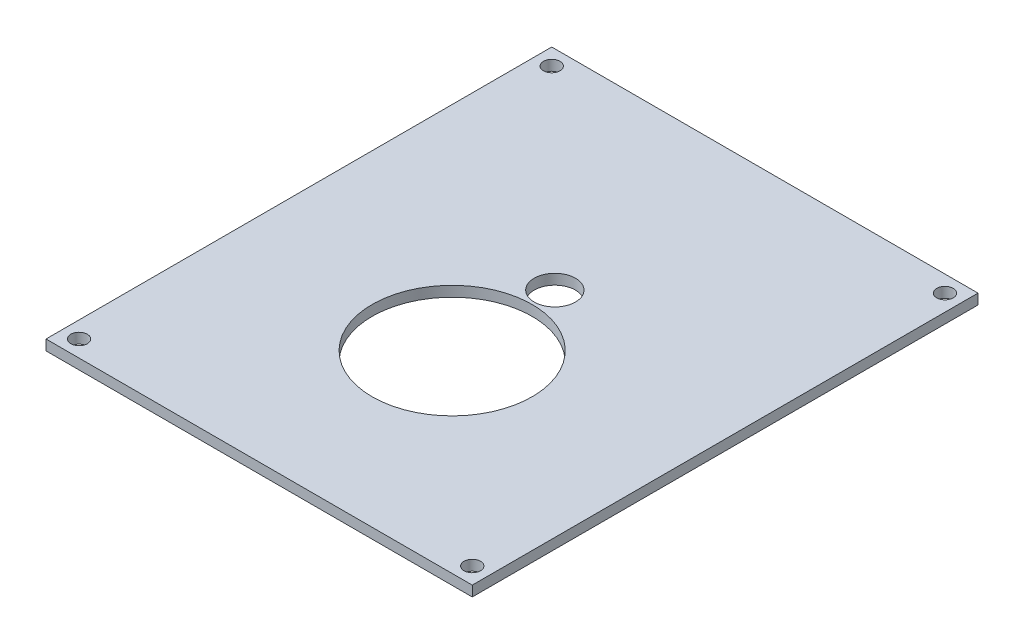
from build123d import *

# Parameters (mm, degrees)
SKETCH1_W                  = 82.6
SKETCH1_H                  = 98
BOSS_EXTRUDE1_DEPTH        = 2
F_3_2_3_2_DIAMETER_HOLE1_D = 3.2
SKETCH4_R                  = 15.5
CUT_EXTRUDE1_DEPTH         = 2
SKETCH5_R                  = 4
CUT_EXTRUDE2_DEPTH         = 10


with BuildPart() as part:
    # Sketch1 → Boss-Extrude1 (new body)
    with BuildSketch(Plane(origin=(0, 0, 0), x_dir=(1, 0, 0), z_dir=(0, 1, 0))):
        Rectangle(SKETCH1_W, SKETCH1_H)
    extrude(amount=BOSS_EXTRUDE1_DEPTH)

    # 3.2 _3.2_ Diameter Hole1 (through all)
    with Locations(Plane(origin=(0, 2, 0), x_dir=(1, 0, 0), z_dir=(0, 1, 0))):
        with Locations((-38.1, 45.8), (38.1, 45.8), (38.1, -45.8), (-38.1, -45.8)):
            Hole(F_3_2_3_2_DIAMETER_HOLE1_D / 2)

    # Sketch4 → Cut-Extrude1 (cut)
    with BuildSketch(Plane(origin=(0, 2, 0), x_dir=(1, 0, 0), z_dir=(0, 1, 0))):
        with Locations(Location((0, -11.6, 0), (0, 0, 270))):
            Circle(SKETCH4_R)
    extrude(amount=-CUT_EXTRUDE1_DEPTH, mode=Mode.SUBTRACT)

    # Sketch5 → Cut-Extrude2 (cut)
    with BuildSketch(Plane.XZ):
        with Locations(Location((-0.2, -8.5, 0), (0, 0, 270))):
            Circle(SKETCH5_R)
    extrude(amount=-CUT_EXTRUDE2_DEPTH, mode=Mode.SUBTRACT)


solid = part.part
